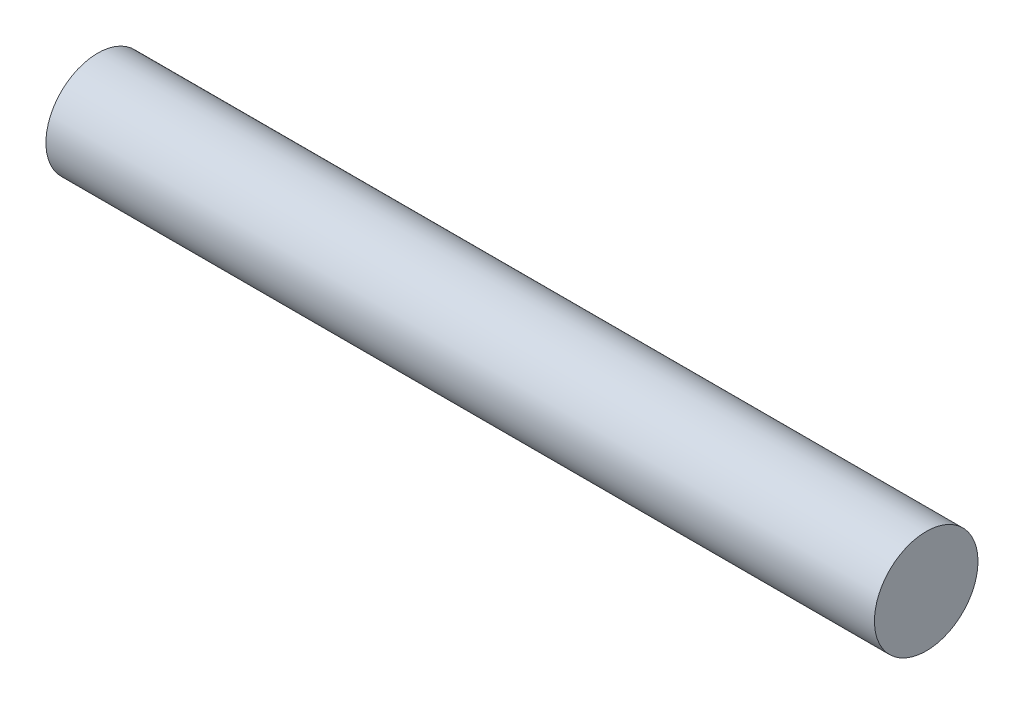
from build123d import *

# Parameters (mm, degrees)
CROQUIS1_R              = 7.5
SALIENTE_EXTRUIR1_DEPTH = 120


with BuildPart() as part:
    # Croquis1 → Saliente-Extruir1 (new body)
    with BuildSketch(Plane(origin=(0, 0, 0), x_dir=(0, 0, -1), z_dir=(1, 0, 0))):
        Circle(CROQUIS1_R)
    extrude(amount=SALIENTE_EXTRUIR1_DEPTH)


solid = part.part
